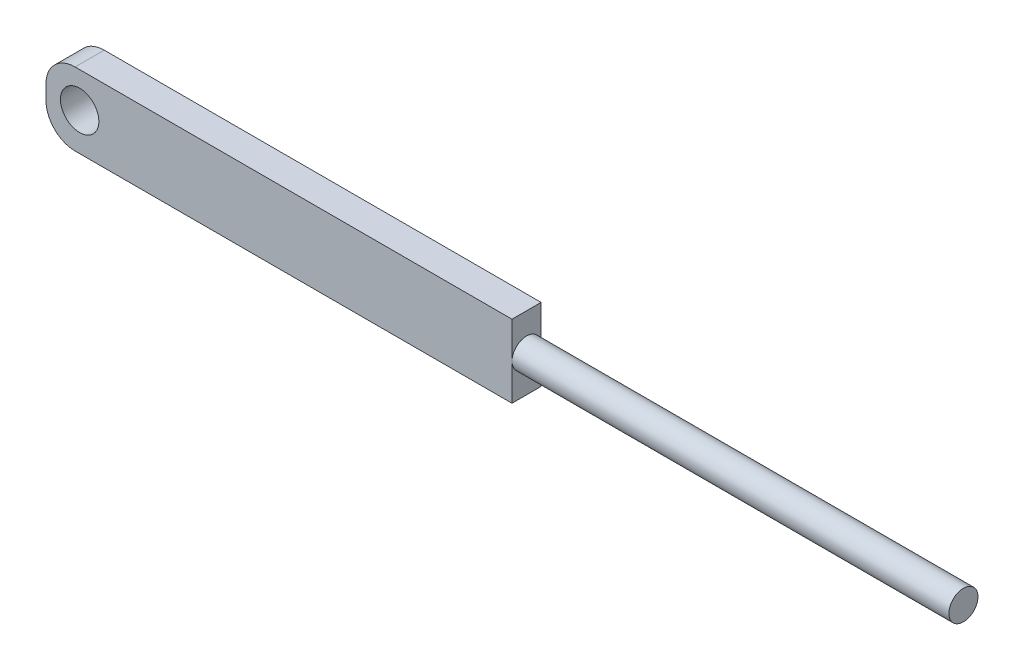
ISO-10303-21;
HEADER;
FILE_DESCRIPTION(('STEP AP214'),'2;1');
FILE_NAME('part.step','',(''),(''),'','','');
FILE_SCHEMA(('AUTOMOTIVE_DESIGN { 1 0 10303 214 1 1 1 1 }'));
ENDSEC;
DATA;
#1=APPLICATION_CONTEXT('core data for automotive mechanical design processes');
#2=APPLICATION_PROTOCOL_DEFINITION('international standard','automotive_design',2000,#1);
#3=PRODUCT_CONTEXT('',#1,'mechanical');
#4=PRODUCT('Part','Part','',(#3));
#5=PRODUCT_RELATED_PRODUCT_CATEGORY('part','',(#4));
#6=PRODUCT_DEFINITION_FORMATION('','',#4);
#7=PRODUCT_DEFINITION_CONTEXT('part definition',#1,'design');
#8=PRODUCT_DEFINITION('design','',#6,#7);
#9=PRODUCT_DEFINITION_SHAPE('','',#8);
#10=(LENGTH_UNIT() NAMED_UNIT(*) SI_UNIT(.MILLI.,.METRE.));
#11=(NAMED_UNIT(*) PLANE_ANGLE_UNIT() SI_UNIT($,.RADIAN.));
#12=(NAMED_UNIT(*) SI_UNIT($,.STERADIAN.) SOLID_ANGLE_UNIT());
#13=UNCERTAINTY_MEASURE_WITH_UNIT(LENGTH_MEASURE(1.E-05),#10,'distance_accuracy_value','');
#14=(GEOMETRIC_REPRESENTATION_CONTEXT(3) GLOBAL_UNCERTAINTY_ASSIGNED_CONTEXT((#13)) GLOBAL_UNIT_ASSIGNED_CONTEXT((#10,
#11,#12)) REPRESENTATION_CONTEXT('',''));
#15=CARTESIAN_POINT('',(0.,0.,0.));
#16=DIRECTION('',(0.,0.,1.));
#17=DIRECTION('',(1.,0.,0.));
#18=AXIS2_PLACEMENT_3D('',#15,#16,#17);
#19=CARTESIAN_POINT('',(160.,0.,10.));
#20=DIRECTION('',(-1.,0.,0.));
#21=DIRECTION('',(0.,0.,1.));
#22=AXIS2_PLACEMENT_3D('',#19,#20,#21);
#23=PLANE('',#22);
#24=CARTESIAN_POINT('',(160.,12.5,5.));
#25=DIRECTION('',(1.,0.,0.));
#26=DIRECTION('',(0.,0.,-1.));
#27=AXIS2_PLACEMENT_3D('',#24,#25,#26);
#28=CIRCLE('',#27,5.);
#29=CARTESIAN_POINT('',(160.,12.5,0.));
#30=VERTEX_POINT('',#29);
#31=CARTESIAN_POINT('',(160.,12.5,10.));
#32=VERTEX_POINT('',#31);
#33=EDGE_CURVE('E50',#30,#32,#28,.T.);
#34=ORIENTED_EDGE('',*,*,#33,.F.);
#35=DIRECTION('',(0.,1.,0.));
#36=VECTOR('',#35,1.);
#37=CARTESIAN_POINT('',(160.,0.,0.));
#38=LINE('',#37,#36);
#39=CARTESIAN_POINT('',(160.,25.,0.));
#40=VERTEX_POINT('',#39);
#41=EDGE_CURVE('E142',#30,#40,#38,.T.);
#42=ORIENTED_EDGE('',*,*,#41,.T.);
#43=DIRECTION('',(0.,0.,-1.));
#44=VECTOR('',#43,1.);
#45=CARTESIAN_POINT('',(160.,25.,10.));
#46=LINE('',#45,#44);
#47=CARTESIAN_POINT('',(160.,25.,10.));
#48=VERTEX_POINT('',#47);
#49=EDGE_CURVE('E43',#48,#40,#46,.T.);
#50=ORIENTED_EDGE('',*,*,#49,.F.);
#51=DIRECTION('',(0.,1.,0.));
#52=VECTOR('',#51,1.);
#53=CARTESIAN_POINT('',(160.,0.,10.));
#54=LINE('',#53,#52);
#55=EDGE_CURVE('E97',#32,#48,#54,.T.);
#56=ORIENTED_EDGE('',*,*,#55,.F.);
#57=EDGE_LOOP('',(#34,#42,#50,#56));
#58=FACE_BOUND('',#57,.T.);
#59=ADVANCED_FACE('F39',(#58),#23,.F.);
#60=EDGE_CURVE('E11',#32,#30,#28,.T.);
#61=ORIENTED_EDGE('',*,*,#60,.F.);
#62=CARTESIAN_POINT('',(160.,0.,10.));
#63=VERTEX_POINT('',#62);
#64=EDGE_CURVE('E185',#63,#32,#54,.T.);
#65=ORIENTED_EDGE('',*,*,#64,.F.);
#66=DIRECTION('',(0.,0.,-1.));
#67=VECTOR('',#66,1.);
#68=CARTESIAN_POINT('',(160.,0.,10.));
#69=LINE('',#68,#67);
#70=CARTESIAN_POINT('',(160.,0.,0.));
#71=VERTEX_POINT('',#70);
#72=EDGE_CURVE('E134',#63,#71,#69,.T.);
#73=ORIENTED_EDGE('',*,*,#72,.T.);
#74=EDGE_CURVE('E138',#71,#30,#38,.T.);
#75=ORIENTED_EDGE('',*,*,#74,.T.);
#76=EDGE_LOOP('',(#61,#65,#73,#75));
#77=FACE_BOUND('',#76,.T.);
#78=ADVANCED_FACE('F41',(#77),#23,.F.);
#79=CARTESIAN_POINT('',(10.0000000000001,25.,10.));
#80=DIRECTION('',(0.,-1.,0.));
#81=DIRECTION('',(0.,0.,-1.));
#82=AXIS2_PLACEMENT_3D('',#79,#80,#81);
#83=PLANE('',#82);
#84=DIRECTION('',(-1.,0.,0.));
#85=VECTOR('',#84,1.);
#86=CARTESIAN_POINT('',(10.0000000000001,25.,0.));
#87=LINE('',#86,#85);
#88=CARTESIAN_POINT('',(10.0000000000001,25.,0.));
#89=VERTEX_POINT('',#88);
#90=EDGE_CURVE('E141',#40,#89,#87,.T.);
#91=ORIENTED_EDGE('',*,*,#90,.T.);
#92=DIRECTION('',(0.,0.,-1.));
#93=VECTOR('',#92,1.);
#94=CARTESIAN_POINT('',(10.0000000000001,25.,10.));
#95=LINE('',#94,#93);
#96=CARTESIAN_POINT('',(10.0000000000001,25.,10.));
#97=VERTEX_POINT('',#96);
#98=EDGE_CURVE('E160',#97,#89,#95,.T.);
#99=ORIENTED_EDGE('',*,*,#98,.F.);
#100=DIRECTION('',(-1.,0.,0.));
#101=VECTOR('',#100,1.);
#102=CARTESIAN_POINT('',(10.0000000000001,25.,10.));
#103=LINE('',#102,#101);
#104=EDGE_CURVE('E172',#48,#97,#103,.T.);
#105=ORIENTED_EDGE('',*,*,#104,.F.);
#106=ORIENTED_EDGE('',*,*,#49,.T.);
#107=EDGE_LOOP('',(#91,#99,#105,#106));
#108=FACE_BOUND('',#107,.T.);
#109=ADVANCED_FACE('F170',(#108),#83,.F.);
#110=CARTESIAN_POINT('',(10.,15.,10.));
#111=DIRECTION('',(0.,0.,-1.));
#112=DIRECTION('',(-1.,0.,0.));
#113=AXIS2_PLACEMENT_3D('',#110,#111,#112);
#114=CYLINDRICAL_SURFACE('',#113,10.);
#115=CARTESIAN_POINT('',(10.,15.,0.));
#116=DIRECTION('',(0.,0.,1.));
#117=DIRECTION('',(-1.,0.,0.));
#118=AXIS2_PLACEMENT_3D('',#115,#116,#117);
#119=CIRCLE('',#118,10.);
#120=CARTESIAN_POINT('',(0.,14.9999999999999,0.));
#121=VERTEX_POINT('',#120);
#122=EDGE_CURVE('E145',#89,#121,#119,.T.);
#123=ORIENTED_EDGE('',*,*,#122,.T.);
#124=DIRECTION('',(0.,0.,-1.));
#125=VECTOR('',#124,1.);
#126=CARTESIAN_POINT('',(0.,14.9999999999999,10.));
#127=LINE('',#126,#125);
#128=CARTESIAN_POINT('',(0.,14.9999999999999,10.));
#129=VERTEX_POINT('',#128);
#130=EDGE_CURVE('E127',#129,#121,#127,.T.);
#131=ORIENTED_EDGE('',*,*,#130,.F.);
#132=CARTESIAN_POINT('',(10.,15.,10.));
#133=DIRECTION('',(0.,0.,1.));
#134=DIRECTION('',(-1.,0.,0.));
#135=AXIS2_PLACEMENT_3D('',#132,#133,#134);
#136=CIRCLE('',#135,10.);
#137=EDGE_CURVE('E113',#97,#129,#136,.T.);
#138=ORIENTED_EDGE('',*,*,#137,.F.);
#139=ORIENTED_EDGE('',*,*,#98,.T.);
#140=EDGE_LOOP('',(#123,#131,#138,#139));
#141=FACE_BOUND('',#140,.T.);
#142=ADVANCED_FACE('F182',(#141),#114,.T.);
#143=CARTESIAN_POINT('',(0.,10.0000000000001,10.));
#144=DIRECTION('',(1.,0.,0.));
#145=DIRECTION('',(0.,0.,-1.));
#146=AXIS2_PLACEMENT_3D('',#143,#144,#145);
#147=PLANE('',#146);
#148=DIRECTION('',(0.,-1.,0.));
#149=VECTOR('',#148,1.);
#150=CARTESIAN_POINT('',(0.,10.0000000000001,0.));
#151=LINE('',#150,#149);
#152=CARTESIAN_POINT('',(0.,10.0000000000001,0.));
#153=VERTEX_POINT('',#152);
#154=EDGE_CURVE('E123',#121,#153,#151,.T.);
#155=ORIENTED_EDGE('',*,*,#154,.T.);
#156=DIRECTION('',(0.,0.,-1.));
#157=VECTOR('',#156,1.);
#158=CARTESIAN_POINT('',(0.,10.0000000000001,10.));
#159=LINE('',#158,#157);
#160=CARTESIAN_POINT('',(0.,10.0000000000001,10.));
#161=VERTEX_POINT('',#160);
#162=EDGE_CURVE('E120',#161,#153,#159,.T.);
#163=ORIENTED_EDGE('',*,*,#162,.F.);
#164=DIRECTION('',(0.,-1.,0.));
#165=VECTOR('',#164,1.);
#166=CARTESIAN_POINT('',(0.,10.0000000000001,10.));
#167=LINE('',#166,#165);
#168=EDGE_CURVE('E106',#129,#161,#167,.T.);
#169=ORIENTED_EDGE('',*,*,#168,.F.);
#170=ORIENTED_EDGE('',*,*,#130,.T.);
#171=EDGE_LOOP('',(#155,#163,#169,#170));
#172=FACE_BOUND('',#171,.T.);
#173=ADVANCED_FACE('F121',(#172),#147,.F.);
#174=CARTESIAN_POINT('',(10.,10.,10.));
#175=DIRECTION('',(0.,0.,-1.));
#176=DIRECTION('',(-1.,0.,0.));
#177=AXIS2_PLACEMENT_3D('',#174,#175,#176);
#178=CYLINDRICAL_SURFACE('',#177,10.);
#179=CARTESIAN_POINT('',(10.,10.,0.));
#180=DIRECTION('',(0.,0.,1.));
#181=DIRECTION('',(-1.,0.,0.));
#182=AXIS2_PLACEMENT_3D('',#179,#180,#181);
#183=CIRCLE('',#182,10.);
#184=CARTESIAN_POINT('',(10.0000000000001,0.,0.));
#185=VERTEX_POINT('',#184);
#186=EDGE_CURVE('E150',#153,#185,#183,.T.);
#187=ORIENTED_EDGE('',*,*,#186,.T.);
#188=DIRECTION('',(0.,0.,-1.));
#189=VECTOR('',#188,1.);
#190=CARTESIAN_POINT('',(10.0000000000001,0.,10.));
#191=LINE('',#190,#189);
#192=CARTESIAN_POINT('',(10.0000000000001,0.,10.));
#193=VERTEX_POINT('',#192);
#194=EDGE_CURVE('E128',#193,#185,#191,.T.);
#195=ORIENTED_EDGE('',*,*,#194,.F.);
#196=CARTESIAN_POINT('',(10.,10.,10.));
#197=DIRECTION('',(0.,0.,1.));
#198=DIRECTION('',(-1.,0.,0.));
#199=AXIS2_PLACEMENT_3D('',#196,#197,#198);
#200=CIRCLE('',#199,10.);
#201=EDGE_CURVE('E110',#161,#193,#200,.T.);
#202=ORIENTED_EDGE('',*,*,#201,.F.);
#203=ORIENTED_EDGE('',*,*,#162,.T.);
#204=EDGE_LOOP('',(#187,#195,#202,#203));
#205=FACE_BOUND('',#204,.T.);
#206=ADVANCED_FACE('F130',(#205),#178,.T.);
#207=CARTESIAN_POINT('',(10.0000000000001,0.,10.));
#208=DIRECTION('',(0.,1.,0.));
#209=DIRECTION('',(0.,0.,1.));
#210=AXIS2_PLACEMENT_3D('',#207,#208,#209);
#211=PLANE('',#210);
#212=DIRECTION('',(1.,0.,0.));
#213=VECTOR('',#212,1.);
#214=CARTESIAN_POINT('',(10.0000000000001,0.,0.));
#215=LINE('',#214,#213);
#216=EDGE_CURVE('E91',#185,#71,#215,.T.);
#217=ORIENTED_EDGE('',*,*,#216,.T.);
#218=ORIENTED_EDGE('',*,*,#72,.F.);
#219=DIRECTION('',(1.,0.,0.));
#220=VECTOR('',#219,1.);
#221=CARTESIAN_POINT('',(10.0000000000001,0.,10.));
#222=LINE('',#221,#220);
#223=EDGE_CURVE('E64',#193,#63,#222,.T.);
#224=ORIENTED_EDGE('',*,*,#223,.F.);
#225=ORIENTED_EDGE('',*,*,#194,.T.);
#226=EDGE_LOOP('',(#217,#218,#224,#225));
#227=FACE_BOUND('',#226,.T.);
#228=ADVANCED_FACE('F212',(#227),#211,.F.);
#229=CARTESIAN_POINT('',(10.,15.,10.));
#230=DIRECTION('',(0.,0.,-1.));
#231=DIRECTION('',(-1.,0.,0.));
#232=AXIS2_PLACEMENT_3D('',#229,#230,#231);
#233=PLANE('',#232);
#234=CARTESIAN_POINT('',(11.5506068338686,12.8664784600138,10.));
#235=DIRECTION('',(0.,0.,1.));
#236=DIRECTION('',(1.,0.,0.));
#237=AXIS2_PLACEMENT_3D('',#234,#235,#236);
#238=CIRCLE('',#237,6.59661228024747);
#239=CARTESIAN_POINT('',(18.147219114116,12.8664784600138,10.));
#240=VERTEX_POINT('',#239);
#241=EDGE_CURVE('E195',#240,#240,#238,.T.);
#242=ORIENTED_EDGE('',*,*,#241,.F.);
#243=EDGE_LOOP('',(#242));
#244=FACE_BOUND('',#243,.T.);
#245=ORIENTED_EDGE('',*,*,#64,.T.);
#246=ORIENTED_EDGE('',*,*,#55,.T.);
#247=ORIENTED_EDGE('',*,*,#104,.T.);
#248=ORIENTED_EDGE('',*,*,#137,.T.);
#249=ORIENTED_EDGE('',*,*,#168,.T.);
#250=ORIENTED_EDGE('',*,*,#201,.T.);
#251=ORIENTED_EDGE('',*,*,#223,.T.);
#252=EDGE_LOOP('',(#245,#246,#247,#248,#249,#250,#251));
#253=FACE_BOUND('',#252,.T.);
#254=ADVANCED_FACE('F108',(#244,#253),#233,.F.);
#255=CARTESIAN_POINT('',(10.,15.,0.));
#256=DIRECTION('',(0.,0.,-1.));
#257=DIRECTION('',(-1.,0.,0.));
#258=AXIS2_PLACEMENT_3D('',#255,#256,#257);
#259=PLANE('',#258);
#260=CARTESIAN_POINT('',(11.5506068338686,12.8664784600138,0.));
#261=DIRECTION('',(0.,0.,1.));
#262=DIRECTION('',(1.,0.,0.));
#263=AXIS2_PLACEMENT_3D('',#260,#261,#262);
#264=CIRCLE('',#263,6.59661228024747);
#265=CARTESIAN_POINT('',(18.147219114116,12.8664784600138,0.));
#266=VERTEX_POINT('',#265);
#267=EDGE_CURVE('E191',#266,#266,#264,.T.);
#268=ORIENTED_EDGE('',*,*,#267,.T.);
#269=EDGE_LOOP('',(#268));
#270=FACE_BOUND('',#269,.T.);
#271=ORIENTED_EDGE('',*,*,#74,.F.);
#272=ORIENTED_EDGE('',*,*,#216,.F.);
#273=ORIENTED_EDGE('',*,*,#186,.F.);
#274=ORIENTED_EDGE('',*,*,#154,.F.);
#275=ORIENTED_EDGE('',*,*,#122,.F.);
#276=ORIENTED_EDGE('',*,*,#90,.F.);
#277=ORIENTED_EDGE('',*,*,#41,.F.);
#278=EDGE_LOOP('',(#271,#272,#273,#274,#275,#276,#277));
#279=FACE_BOUND('',#278,.T.);
#280=ADVANCED_FACE('F181',(#270,#279),#259,.T.);
#281=CARTESIAN_POINT('',(310.,12.5,5.));
#282=DIRECTION('',(-1.,0.,0.));
#283=DIRECTION('',(0.,0.,1.));
#284=AXIS2_PLACEMENT_3D('',#281,#282,#283);
#285=CYLINDRICAL_SURFACE('',#284,5.);
#286=CARTESIAN_POINT('',(310.,12.5,5.));
#287=DIRECTION('',(1.,0.,0.));
#288=DIRECTION('',(0.,0.,-1.));
#289=AXIS2_PLACEMENT_3D('',#286,#287,#288);
#290=CIRCLE('',#289,5.);
#291=CARTESIAN_POINT('',(310.,12.5,0.));
#292=VERTEX_POINT('',#291);
#293=EDGE_CURVE('E180',#292,#292,#290,.T.);
#294=ORIENTED_EDGE('',*,*,#293,.F.);
#295=EDGE_LOOP('',(#294));
#296=FACE_BOUND('',#295,.T.);
#297=ORIENTED_EDGE('',*,*,#33,.T.);
#298=ORIENTED_EDGE('',*,*,#60,.T.);
#299=EDGE_LOOP('',(#297,#298));
#300=FACE_BOUND('',#299,.T.);
#301=ADVANCED_FACE('F218',(#296,#300),#285,.T.);
#302=CARTESIAN_POINT('',(310.,12.5,5.));
#303=DIRECTION('',(1.,0.,0.));
#304=DIRECTION('',(0.,0.,-1.));
#305=AXIS2_PLACEMENT_3D('',#302,#303,#304);
#306=PLANE('',#305);
#307=ORIENTED_EDGE('',*,*,#293,.T.);
#308=EDGE_LOOP('',(#307));
#309=FACE_BOUND('',#308,.T.);
#310=ADVANCED_FACE('F207',(#309),#306,.T.);
#311=CARTESIAN_POINT('',(11.5506068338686,12.8664784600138,0.));
#312=DIRECTION('',(0.,0.,1.));
#313=DIRECTION('',(1.,0.,0.));
#314=AXIS2_PLACEMENT_3D('',#311,#312,#313);
#315=CYLINDRICAL_SURFACE('',#314,6.59661228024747);
#316=ORIENTED_EDGE('',*,*,#267,.F.);
#317=EDGE_LOOP('',(#316));
#318=FACE_BOUND('',#317,.T.);
#319=ORIENTED_EDGE('',*,*,#241,.T.);
#320=EDGE_LOOP('',(#319));
#321=FACE_BOUND('',#320,.T.);
#322=ADVANCED_FACE('F204',(#318,#321),#315,.F.);
#323=CLOSED_SHELL('',(#59,#78,#109,#142,#173,#206,#228,#254,#280,#301,#310,#322));
#324=MANIFOLD_SOLID_BREP('B2',#323);
#325=ADVANCED_BREP_SHAPE_REPRESENTATION('',(#18,#324),#14);
#326=SHAPE_DEFINITION_REPRESENTATION(#9,#325);
ENDSEC;
END-ISO-10303-21;
